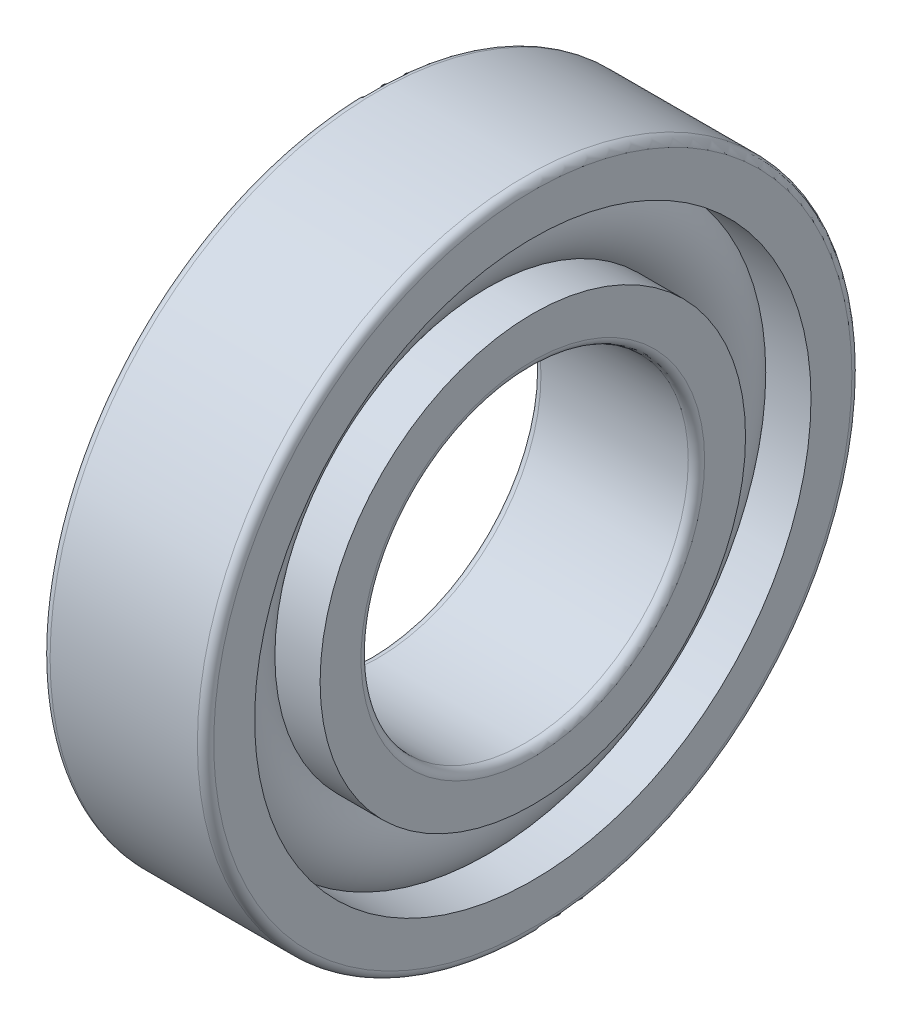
ISO-10303-21;
HEADER;
FILE_DESCRIPTION(('STEP AP214'),'2;1');
FILE_NAME('part.step','',(''),(''),'','','');
FILE_SCHEMA(('AUTOMOTIVE_DESIGN { 1 0 10303 214 1 1 1 1 }'));
ENDSEC;
DATA;
#1=APPLICATION_CONTEXT('core data for automotive mechanical design processes');
#2=APPLICATION_PROTOCOL_DEFINITION('international standard','automotive_design',2000,#1);
#3=PRODUCT_CONTEXT('',#1,'mechanical');
#4=PRODUCT('Part','Part','',(#3));
#5=PRODUCT_RELATED_PRODUCT_CATEGORY('part','',(#4));
#6=PRODUCT_DEFINITION_FORMATION('','',#4);
#7=PRODUCT_DEFINITION_CONTEXT('part definition',#1,'design');
#8=PRODUCT_DEFINITION('design','',#6,#7);
#9=PRODUCT_DEFINITION_SHAPE('','',#8);
#10=(LENGTH_UNIT() NAMED_UNIT(*) SI_UNIT(.MILLI.,.METRE.));
#11=(NAMED_UNIT(*) PLANE_ANGLE_UNIT() SI_UNIT($,.RADIAN.));
#12=(NAMED_UNIT(*) SI_UNIT($,.STERADIAN.) SOLID_ANGLE_UNIT());
#13=UNCERTAINTY_MEASURE_WITH_UNIT(LENGTH_MEASURE(1.E-05),#10,'distance_accuracy_value','');
#14=(GEOMETRIC_REPRESENTATION_CONTEXT(3) GLOBAL_UNCERTAINTY_ASSIGNED_CONTEXT((#13)) GLOBAL_UNIT_ASSIGNED_CONTEXT((#10,
#11,#12)) REPRESENTATION_CONTEXT('',''));
#15=CARTESIAN_POINT('',(0.,0.,0.));
#16=DIRECTION('',(0.,0.,1.));
#17=DIRECTION('',(1.,0.,0.));
#18=AXIS2_PLACEMENT_3D('',#15,#16,#17);
#19=CARTESIAN_POINT('',(0.,0.,0.));
#20=DIRECTION('',(-1.,0.,0.));
#21=DIRECTION('',(0.,0.,1.));
#22=AXIS2_PLACEMENT_3D('',#19,#20,#21);
#23=TOROIDAL_SURFACE('',#22,6.,1.2);
#24=CARTESIAN_POINT('',(0.894427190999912,0.,0.));
#25=DIRECTION('',(-1.,0.,0.));
#26=DIRECTION('',(0.,0.,1.));
#27=AXIS2_PLACEMENT_3D('',#24,#25,#26);
#28=CIRCLE('',#27,6.8);
#29=CARTESIAN_POINT('',(0.894427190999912,0.,6.8));
#30=VERTEX_POINT('',#29);
#31=EDGE_CURVE('E34',#30,#30,#28,.F.);
#32=ORIENTED_EDGE('',*,*,#31,.T.);
#33=EDGE_LOOP('',(#32));
#34=FACE_BOUND('',#33,.T.);
#35=CARTESIAN_POINT('',(0.894427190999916,0.,0.));
#36=DIRECTION('',(-1.,0.,0.));
#37=DIRECTION('',(0.,0.,1.));
#38=AXIS2_PLACEMENT_3D('',#35,#36,#37);
#39=CIRCLE('',#38,5.2);
#40=CARTESIAN_POINT('',(0.894427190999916,0.,5.2));
#41=VERTEX_POINT('',#40);
#42=EDGE_CURVE('E10',#41,#41,#39,.T.);
#43=ORIENTED_EDGE('',*,*,#42,.T.);
#44=EDGE_LOOP('',(#43));
#45=FACE_BOUND('',#44,.T.);
#46=ADVANCED_FACE('F30',(#34,#45),#23,.T.);
#47=CARTESIAN_POINT('',(-20.6375,0.,0.));
#48=DIRECTION('',(1.,0.,0.));
#49=DIRECTION('',(0.,0.,-1.));
#50=AXIS2_PLACEMENT_3D('',#47,#48,#49);
#51=CYLINDRICAL_SURFACE('',#50,5.2);
#52=CARTESIAN_POINT('',(2.,0.,0.));
#53=DIRECTION('',(1.,0.,0.));
#54=DIRECTION('',(0.,0.,-1.));
#55=AXIS2_PLACEMENT_3D('',#52,#53,#54);
#56=CIRCLE('',#55,5.2);
#57=CARTESIAN_POINT('',(2.,0.,-5.2));
#58=VERTEX_POINT('',#57);
#59=EDGE_CURVE('E43',#58,#58,#56,.T.);
#60=ORIENTED_EDGE('',*,*,#59,.F.);
#61=EDGE_LOOP('',(#60));
#62=FACE_BOUND('',#61,.T.);
#63=ORIENTED_EDGE('',*,*,#42,.F.);
#64=EDGE_LOOP('',(#63));
#65=FACE_BOUND('',#64,.T.);
#66=ADVANCED_FACE('F82',(#62,#65),#51,.T.);
#67=CARTESIAN_POINT('',(-20.6375,0.,0.));
#68=DIRECTION('',(1.,0.,0.));
#69=DIRECTION('',(0.,0.,-1.));
#70=AXIS2_PLACEMENT_3D('',#67,#68,#69);
#71=CYLINDRICAL_SURFACE('',#70,5.2);
#72=CARTESIAN_POINT('',(-2.,0.,0.));
#73=DIRECTION('',(1.,0.,0.));
#74=DIRECTION('',(0.,0.,-1.));
#75=AXIS2_PLACEMENT_3D('',#72,#73,#74);
#76=CIRCLE('',#75,5.2);
#77=CARTESIAN_POINT('',(-2.,0.,-5.2));
#78=VERTEX_POINT('',#77);
#79=EDGE_CURVE('E52',#78,#78,#76,.T.);
#80=ORIENTED_EDGE('',*,*,#79,.T.);
#81=EDGE_LOOP('',(#80));
#82=FACE_BOUND('',#81,.T.);
#83=CARTESIAN_POINT('',(-0.894427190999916,0.,0.));
#84=DIRECTION('',(1.,0.,0.));
#85=DIRECTION('',(0.,0.,-1.));
#86=AXIS2_PLACEMENT_3D('',#83,#84,#85);
#87=CIRCLE('',#86,5.2);
#88=CARTESIAN_POINT('',(-0.894427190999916,0.,-5.2));
#89=VERTEX_POINT('',#88);
#90=EDGE_CURVE('E38',#89,#89,#87,.T.);
#91=ORIENTED_EDGE('',*,*,#90,.F.);
#92=EDGE_LOOP('',(#91));
#93=FACE_BOUND('',#92,.T.);
#94=ADVANCED_FACE('F85',(#82,#93),#71,.T.);
#95=CARTESIAN_POINT('',(2.,4.2,0.));
#96=DIRECTION('',(1.,0.,0.));
#97=DIRECTION('',(0.,0.,-1.));
#98=AXIS2_PLACEMENT_3D('',#95,#96,#97);
#99=PLANE('',#98);
#100=ORIENTED_EDGE('',*,*,#59,.T.);
#101=EDGE_LOOP('',(#100));
#102=FACE_BOUND('',#101,.T.);
#103=CARTESIAN_POINT('',(2.,0.,0.));
#104=DIRECTION('',(1.,0.,0.));
#105=DIRECTION('',(0.,0.,-1.));
#106=AXIS2_PLACEMENT_3D('',#103,#104,#105);
#107=CIRCLE('',#106,4.2);
#108=CARTESIAN_POINT('',(2.,0.,-4.2));
#109=VERTEX_POINT('',#108);
#110=EDGE_CURVE('E74',#109,#109,#107,.T.);
#111=ORIENTED_EDGE('',*,*,#110,.F.);
#112=EDGE_LOOP('',(#111));
#113=FACE_BOUND('',#112,.T.);
#114=ADVANCED_FACE('F79',(#102,#113),#99,.T.);
#115=CARTESIAN_POINT('',(1.8,0.,0.));
#116=DIRECTION('',(1.,0.,0.));
#117=DIRECTION('',(0.,0.,-1.));
#118=AXIS2_PLACEMENT_3D('',#115,#116,#117);
#119=TOROIDAL_SURFACE('',#118,4.2,0.2);
#120=ORIENTED_EDGE('',*,*,#110,.T.);
#121=EDGE_LOOP('',(#120));
#122=FACE_BOUND('',#121,.T.);
#123=CARTESIAN_POINT('',(1.8,0.,0.));
#124=DIRECTION('',(1.,0.,0.));
#125=DIRECTION('',(0.,0.,-1.));
#126=AXIS2_PLACEMENT_3D('',#123,#124,#125);
#127=CIRCLE('',#126,4.);
#128=CARTESIAN_POINT('',(1.8,0.,-4.));
#129=VERTEX_POINT('',#128);
#130=EDGE_CURVE('E71',#129,#129,#127,.T.);
#131=ORIENTED_EDGE('',*,*,#130,.F.);
#132=EDGE_LOOP('',(#131));
#133=FACE_BOUND('',#132,.T.);
#134=ADVANCED_FACE('F96',(#122,#133),#119,.T.);
#135=CARTESIAN_POINT('',(-20.6375,0.,0.));
#136=DIRECTION('',(1.,0.,0.));
#137=DIRECTION('',(0.,0.,-1.));
#138=AXIS2_PLACEMENT_3D('',#135,#136,#137);
#139=CYLINDRICAL_SURFACE('',#138,4.);
#140=ORIENTED_EDGE('',*,*,#130,.T.);
#141=EDGE_LOOP('',(#140));
#142=FACE_BOUND('',#141,.T.);
#143=CARTESIAN_POINT('',(-1.8,0.,0.));
#144=DIRECTION('',(1.,0.,0.));
#145=DIRECTION('',(0.,0.,-1.));
#146=AXIS2_PLACEMENT_3D('',#143,#144,#145);
#147=CIRCLE('',#146,4.);
#148=CARTESIAN_POINT('',(-1.8,0.,-4.));
#149=VERTEX_POINT('',#148);
#150=EDGE_CURVE('E68',#149,#149,#147,.T.);
#151=ORIENTED_EDGE('',*,*,#150,.F.);
#152=EDGE_LOOP('',(#151));
#153=FACE_BOUND('',#152,.T.);
#154=ADVANCED_FACE('F99',(#142,#153),#139,.F.);
#155=CARTESIAN_POINT('',(-1.8,0.,0.));
#156=DIRECTION('',(1.,0.,0.));
#157=DIRECTION('',(0.,0.,-1.));
#158=AXIS2_PLACEMENT_3D('',#155,#156,#157);
#159=TOROIDAL_SURFACE('',#158,4.2,0.2);
#160=ORIENTED_EDGE('',*,*,#150,.T.);
#161=EDGE_LOOP('',(#160));
#162=FACE_BOUND('',#161,.T.);
#163=CARTESIAN_POINT('',(-2.,0.,0.));
#164=DIRECTION('',(1.,0.,0.));
#165=DIRECTION('',(0.,0.,-1.));
#166=AXIS2_PLACEMENT_3D('',#163,#164,#165);
#167=CIRCLE('',#166,4.2);
#168=CARTESIAN_POINT('',(-2.,0.,-4.2));
#169=VERTEX_POINT('',#168);
#170=EDGE_CURVE('E65',#169,#169,#167,.T.);
#171=ORIENTED_EDGE('',*,*,#170,.F.);
#172=EDGE_LOOP('',(#171));
#173=FACE_BOUND('',#172,.T.);
#174=ADVANCED_FACE('F103',(#162,#173),#159,.T.);
#175=CARTESIAN_POINT('',(-2.,5.2,0.));
#176=DIRECTION('',(-1.,0.,0.));
#177=DIRECTION('',(0.,0.,1.));
#178=AXIS2_PLACEMENT_3D('',#175,#176,#177);
#179=PLANE('',#178);
#180=ORIENTED_EDGE('',*,*,#170,.T.);
#181=EDGE_LOOP('',(#180));
#182=FACE_BOUND('',#181,.T.);
#183=ORIENTED_EDGE('',*,*,#79,.F.);
#184=EDGE_LOOP('',(#183));
#185=FACE_BOUND('',#184,.T.);
#186=ADVANCED_FACE('F107',(#182,#185),#179,.T.);
#187=CARTESIAN_POINT('',(-0.894427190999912,0.,0.));
#188=DIRECTION('',(1.,0.,0.));
#189=DIRECTION('',(0.,0.,-1.));
#190=AXIS2_PLACEMENT_3D('',#187,#188,#189);
#191=CIRCLE('',#190,6.8);
#192=CARTESIAN_POINT('',(-0.894427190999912,0.,-6.8));
#193=VERTEX_POINT('',#192);
#194=EDGE_CURVE('E46',#193,#193,#191,.F.);
#195=ORIENTED_EDGE('',*,*,#194,.T.);
#196=EDGE_LOOP('',(#195));
#197=FACE_BOUND('',#196,.T.);
#198=ORIENTED_EDGE('',*,*,#90,.T.);
#199=EDGE_LOOP('',(#198));
#200=FACE_BOUND('',#199,.T.);
#201=ADVANCED_FACE('F32',(#197,#200),#23,.T.);
#202=CARTESIAN_POINT('',(-20.6375,0.,0.));
#203=DIRECTION('',(1.,0.,0.));
#204=DIRECTION('',(0.,0.,-1.));
#205=AXIS2_PLACEMENT_3D('',#202,#203,#204);
#206=CYLINDRICAL_SURFACE('',#205,6.8);
#207=CARTESIAN_POINT('',(2.,0.,0.));
#208=DIRECTION('',(1.,0.,0.));
#209=DIRECTION('',(0.,0.,-1.));
#210=AXIS2_PLACEMENT_3D('',#207,#208,#209);
#211=CIRCLE('',#210,6.80000000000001);
#212=CARTESIAN_POINT('',(2.,0.,-6.80000000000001));
#213=VERTEX_POINT('',#212);
#214=EDGE_CURVE('E48',#213,#213,#211,.T.);
#215=ORIENTED_EDGE('',*,*,#214,.T.);
#216=EDGE_LOOP('',(#215));
#217=FACE_BOUND('',#216,.T.);
#218=ORIENTED_EDGE('',*,*,#31,.F.);
#219=EDGE_LOOP('',(#218));
#220=FACE_BOUND('',#219,.T.);
#221=ADVANCED_FACE('F112',(#217,#220),#206,.F.);
#222=CARTESIAN_POINT('',(-20.6375,0.,0.));
#223=DIRECTION('',(1.,0.,0.));
#224=DIRECTION('',(0.,0.,-1.));
#225=AXIS2_PLACEMENT_3D('',#222,#223,#224);
#226=CYLINDRICAL_SURFACE('',#225,6.8);
#227=CARTESIAN_POINT('',(-2.,0.,0.));
#228=DIRECTION('',(1.,0.,0.));
#229=DIRECTION('',(0.,0.,-1.));
#230=AXIS2_PLACEMENT_3D('',#227,#228,#229);
#231=CIRCLE('',#230,6.80000000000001);
#232=CARTESIAN_POINT('',(-2.,0.,-6.80000000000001));
#233=VERTEX_POINT('',#232);
#234=EDGE_CURVE('E143',#233,#233,#231,.T.);
#235=ORIENTED_EDGE('',*,*,#234,.F.);
#236=EDGE_LOOP('',(#235));
#237=FACE_BOUND('',#236,.T.);
#238=ORIENTED_EDGE('',*,*,#194,.F.);
#239=EDGE_LOOP('',(#238));
#240=FACE_BOUND('',#239,.T.);
#241=ADVANCED_FACE('F115',(#237,#240),#226,.F.);
#242=CARTESIAN_POINT('',(2.,7.80000000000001,0.));
#243=DIRECTION('',(1.,0.,0.));
#244=DIRECTION('',(0.,0.,-1.));
#245=AXIS2_PLACEMENT_3D('',#242,#243,#244);
#246=PLANE('',#245);
#247=CARTESIAN_POINT('',(2.,0.,0.));
#248=DIRECTION('',(1.,0.,0.));
#249=DIRECTION('',(0.,0.,-1.));
#250=AXIS2_PLACEMENT_3D('',#247,#248,#249);
#251=CIRCLE('',#250,7.80000000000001);
#252=CARTESIAN_POINT('',(2.,0.,-7.80000000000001));
#253=VERTEX_POINT('',#252);
#254=EDGE_CURVE('E54',#253,#253,#251,.T.);
#255=ORIENTED_EDGE('',*,*,#254,.T.);
#256=EDGE_LOOP('',(#255));
#257=FACE_BOUND('',#256,.T.);
#258=ORIENTED_EDGE('',*,*,#214,.F.);
#259=EDGE_LOOP('',(#258));
#260=FACE_BOUND('',#259,.T.);
#261=ADVANCED_FACE('F116',(#257,#260),#246,.T.);
#262=CARTESIAN_POINT('',(1.8,0.,0.));
#263=DIRECTION('',(1.,0.,0.));
#264=DIRECTION('',(0.,0.,-1.));
#265=AXIS2_PLACEMENT_3D('',#262,#263,#264);
#266=TOROIDAL_SURFACE('',#265,7.80000000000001,0.2);
#267=CARTESIAN_POINT('',(1.8,0.,0.));
#268=DIRECTION('',(1.,0.,0.));
#269=DIRECTION('',(0.,0.,-1.));
#270=AXIS2_PLACEMENT_3D('',#267,#268,#269);
#271=CIRCLE('',#270,8.00000000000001);
#272=CARTESIAN_POINT('',(1.8,0.,-8.00000000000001));
#273=VERTEX_POINT('',#272);
#274=EDGE_CURVE('E59',#273,#273,#271,.T.);
#275=ORIENTED_EDGE('',*,*,#274,.T.);
#276=EDGE_LOOP('',(#275));
#277=FACE_BOUND('',#276,.T.);
#278=ORIENTED_EDGE('',*,*,#254,.F.);
#279=EDGE_LOOP('',(#278));
#280=FACE_BOUND('',#279,.T.);
#281=ADVANCED_FACE('F119',(#277,#280),#266,.T.);
#282=CARTESIAN_POINT('',(-20.6375,0.,0.));
#283=DIRECTION('',(1.,0.,0.));
#284=DIRECTION('',(0.,0.,-1.));
#285=AXIS2_PLACEMENT_3D('',#282,#283,#284);
#286=CYLINDRICAL_SURFACE('',#285,8.00000000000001);
#287=CARTESIAN_POINT('',(-1.8,0.,0.));
#288=DIRECTION('',(1.,0.,0.));
#289=DIRECTION('',(0.,0.,-1.));
#290=AXIS2_PLACEMENT_3D('',#287,#288,#289);
#291=CIRCLE('',#290,8.00000000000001);
#292=CARTESIAN_POINT('',(-1.8,0.,-8.00000000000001));
#293=VERTEX_POINT('',#292);
#294=EDGE_CURVE('E147',#293,#293,#291,.T.);
#295=ORIENTED_EDGE('',*,*,#294,.T.);
#296=EDGE_LOOP('',(#295));
#297=FACE_BOUND('',#296,.T.);
#298=ORIENTED_EDGE('',*,*,#274,.F.);
#299=EDGE_LOOP('',(#298));
#300=FACE_BOUND('',#299,.T.);
#301=ADVANCED_FACE('F123',(#297,#300),#286,.T.);
#302=CARTESIAN_POINT('',(-1.8,0.,0.));
#303=DIRECTION('',(1.,0.,0.));
#304=DIRECTION('',(0.,0.,-1.));
#305=AXIS2_PLACEMENT_3D('',#302,#303,#304);
#306=TOROIDAL_SURFACE('',#305,7.80000000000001,0.2);
#307=CARTESIAN_POINT('',(-2.,0.,0.));
#308=DIRECTION('',(1.,0.,0.));
#309=DIRECTION('',(0.,0.,-1.));
#310=AXIS2_PLACEMENT_3D('',#307,#308,#309);
#311=CIRCLE('',#310,7.80000000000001);
#312=CARTESIAN_POINT('',(-2.,0.,-7.80000000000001));
#313=VERTEX_POINT('',#312);
#314=EDGE_CURVE('E144',#313,#313,#311,.T.);
#315=ORIENTED_EDGE('',*,*,#314,.T.);
#316=EDGE_LOOP('',(#315));
#317=FACE_BOUND('',#316,.T.);
#318=ORIENTED_EDGE('',*,*,#294,.F.);
#319=EDGE_LOOP('',(#318));
#320=FACE_BOUND('',#319,.T.);
#321=ADVANCED_FACE('F127',(#317,#320),#306,.T.);
#322=CARTESIAN_POINT('',(-2.,6.80000000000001,0.));
#323=DIRECTION('',(-1.,0.,0.));
#324=DIRECTION('',(0.,0.,1.));
#325=AXIS2_PLACEMENT_3D('',#322,#323,#324);
#326=PLANE('',#325);
#327=ORIENTED_EDGE('',*,*,#234,.T.);
#328=EDGE_LOOP('',(#327));
#329=FACE_BOUND('',#328,.T.);
#330=ORIENTED_EDGE('',*,*,#314,.F.);
#331=EDGE_LOOP('',(#330));
#332=FACE_BOUND('',#331,.T.);
#333=ADVANCED_FACE('F131',(#329,#332),#326,.T.);
#334=CLOSED_SHELL('',(#46,#66,#94,#114,#134,#154,#174,#186,#201,#221,#241,#261,#281,#301,#321,#333));
#335=MANIFOLD_SOLID_BREP('B2',#334);
#336=ADVANCED_BREP_SHAPE_REPRESENTATION('',(#18,#335),#14);
#337=SHAPE_DEFINITION_REPRESENTATION(#9,#336);
ENDSEC;
END-ISO-10303-21;
